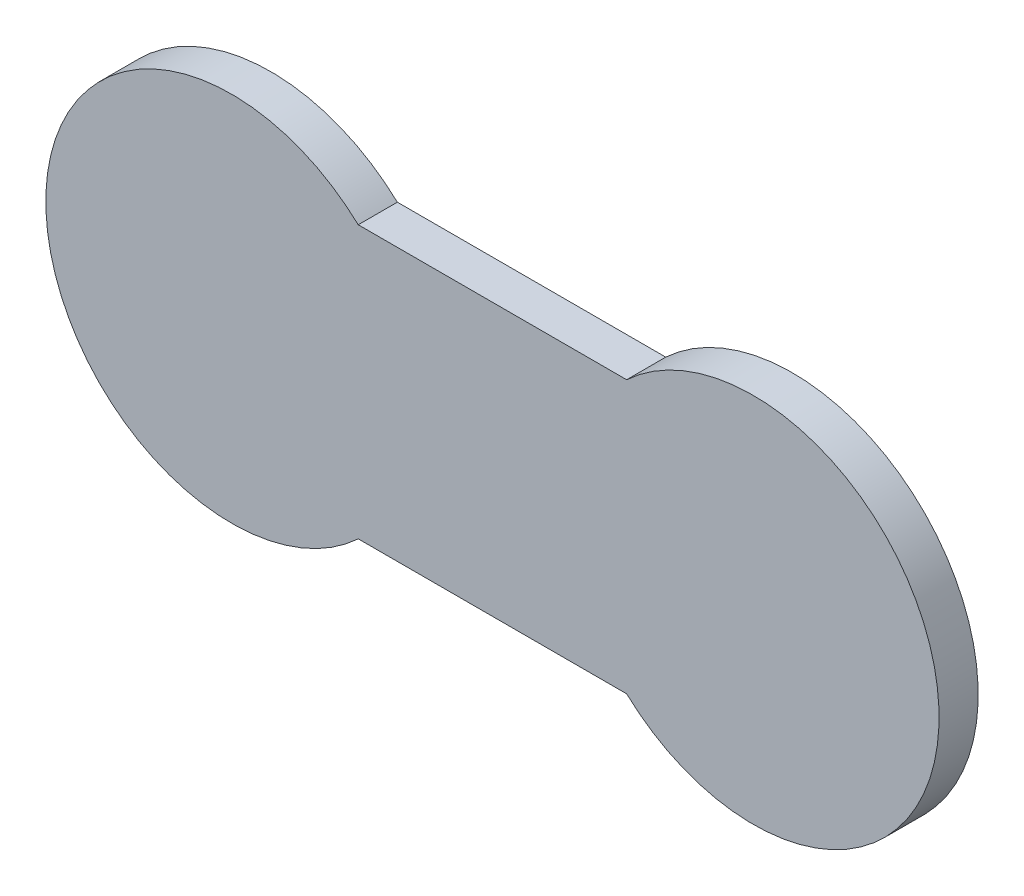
ISO-10303-21;
HEADER;
FILE_DESCRIPTION(('STEP AP214'),'2;1');
FILE_NAME('part.step','',(''),(''),'','','');
FILE_SCHEMA(('AUTOMOTIVE_DESIGN { 1 0 10303 214 1 1 1 1 }'));
ENDSEC;
DATA;
#1=APPLICATION_CONTEXT('core data for automotive mechanical design processes');
#2=APPLICATION_PROTOCOL_DEFINITION('international standard','automotive_design',2000,#1);
#3=PRODUCT_CONTEXT('',#1,'mechanical');
#4=PRODUCT('Part','Part','',(#3));
#5=PRODUCT_RELATED_PRODUCT_CATEGORY('part','',(#4));
#6=PRODUCT_DEFINITION_FORMATION('','',#4);
#7=PRODUCT_DEFINITION_CONTEXT('part definition',#1,'design');
#8=PRODUCT_DEFINITION('design','',#6,#7);
#9=PRODUCT_DEFINITION_SHAPE('','',#8);
#10=(LENGTH_UNIT() NAMED_UNIT(*) SI_UNIT(.MILLI.,.METRE.));
#11=(NAMED_UNIT(*) PLANE_ANGLE_UNIT() SI_UNIT($,.RADIAN.));
#12=(NAMED_UNIT(*) SI_UNIT($,.STERADIAN.) SOLID_ANGLE_UNIT());
#13=UNCERTAINTY_MEASURE_WITH_UNIT(LENGTH_MEASURE(1.E-05),#10,'distance_accuracy_value','');
#14=(GEOMETRIC_REPRESENTATION_CONTEXT(3) GLOBAL_UNCERTAINTY_ASSIGNED_CONTEXT((#13)) GLOBAL_UNIT_ASSIGNED_CONTEXT((#10,
#11,#12)) REPRESENTATION_CONTEXT('',''));
#15=CARTESIAN_POINT('',(0.,0.,0.));
#16=DIRECTION('',(0.,0.,1.));
#17=DIRECTION('',(1.,0.,0.));
#18=AXIS2_PLACEMENT_3D('',#15,#16,#17);
#19=CARTESIAN_POINT('',(30.,29.8606797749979,6.));
#20=DIRECTION('',(0.,0.,-1.));
#21=DIRECTION('',(-1.,0.,0.));
#22=AXIS2_PLACEMENT_3D('',#19,#20,#21);
#23=CYLINDRICAL_SURFACE('',#22,28.5);
#24=CARTESIAN_POINT('',(30.,29.8606797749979,0.));
#25=DIRECTION('',(0.,0.,1.));
#26=DIRECTION('',(1.,0.,0.));
#27=AXIS2_PLACEMENT_3D('',#24,#25,#26);
#28=CIRCLE('',#27,28.5);
#29=CARTESIAN_POINT('',(49.4186003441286,50.7213595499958,0.));
#30=VERTEX_POINT('',#29);
#31=CARTESIAN_POINT('',(49.4186003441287,9.,0.));
#32=VERTEX_POINT('',#31);
#33=EDGE_CURVE('E98',#30,#32,#28,.T.);
#34=ORIENTED_EDGE('',*,*,#33,.T.);
#35=DIRECTION('',(0.,0.,-1.));
#36=VECTOR('',#35,1.);
#37=CARTESIAN_POINT('',(49.4186003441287,9.,6.));
#38=LINE('',#37,#36);
#39=CARTESIAN_POINT('',(49.4186003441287,9.,6.));
#40=VERTEX_POINT('',#39);
#41=EDGE_CURVE('E11',#40,#32,#38,.T.);
#42=ORIENTED_EDGE('',*,*,#41,.F.);
#43=CARTESIAN_POINT('',(30.,29.8606797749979,6.));
#44=DIRECTION('',(0.,0.,1.));
#45=DIRECTION('',(1.,0.,0.));
#46=AXIS2_PLACEMENT_3D('',#43,#44,#45);
#47=CIRCLE('',#46,28.5);
#48=CARTESIAN_POINT('',(49.4186003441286,50.7213595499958,6.));
#49=VERTEX_POINT('',#48);
#50=EDGE_CURVE('E86',#49,#40,#47,.T.);
#51=ORIENTED_EDGE('',*,*,#50,.F.);
#52=DIRECTION('',(0.,0.,-1.));
#53=VECTOR('',#52,1.);
#54=CARTESIAN_POINT('',(49.4186003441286,50.7213595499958,6.));
#55=LINE('',#54,#53);
#56=EDGE_CURVE('E94',#49,#30,#55,.T.);
#57=ORIENTED_EDGE('',*,*,#56,.T.);
#58=EDGE_LOOP('',(#34,#42,#51,#57));
#59=FACE_BOUND('',#58,.T.);
#60=ADVANCED_FACE('F35',(#59),#23,.T.);
#61=CARTESIAN_POINT('',(49.4186003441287,9.,6.));
#62=DIRECTION('',(0.,1.,0.));
#63=DIRECTION('',(0.,0.,1.));
#64=AXIS2_PLACEMENT_3D('',#61,#62,#63);
#65=PLANE('',#64);
#66=DIRECTION('',(1.,0.,0.));
#67=VECTOR('',#66,1.);
#68=CARTESIAN_POINT('',(49.4186003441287,9.,0.));
#69=LINE('',#68,#67);
#70=CARTESIAN_POINT('',(90.5813996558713,9.,0.));
#71=VERTEX_POINT('',#70);
#72=EDGE_CURVE('E90',#32,#71,#69,.T.);
#73=ORIENTED_EDGE('',*,*,#72,.T.);
#74=DIRECTION('',(0.,0.,-1.));
#75=VECTOR('',#74,1.);
#76=CARTESIAN_POINT('',(90.5813996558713,9.,6.));
#77=LINE('',#76,#75);
#78=CARTESIAN_POINT('',(90.5813996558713,9.,6.));
#79=VERTEX_POINT('',#78);
#80=EDGE_CURVE('E43',#79,#71,#77,.T.);
#81=ORIENTED_EDGE('',*,*,#80,.F.);
#82=DIRECTION('',(1.,0.,0.));
#83=VECTOR('',#82,1.);
#84=CARTESIAN_POINT('',(49.4186003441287,9.,6.));
#85=LINE('',#84,#83);
#86=EDGE_CURVE('E81',#40,#79,#85,.T.);
#87=ORIENTED_EDGE('',*,*,#86,.F.);
#88=ORIENTED_EDGE('',*,*,#41,.T.);
#89=EDGE_LOOP('',(#73,#81,#87,#88));
#90=FACE_BOUND('',#89,.T.);
#91=ADVANCED_FACE('F89',(#90),#65,.F.);
#92=CARTESIAN_POINT('',(110.,29.8606797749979,6.));
#93=DIRECTION('',(0.,0.,-1.));
#94=DIRECTION('',(-1.,0.,0.));
#95=AXIS2_PLACEMENT_3D('',#92,#93,#94);
#96=CYLINDRICAL_SURFACE('',#95,28.5);
#97=CARTESIAN_POINT('',(110.,29.8606797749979,0.));
#98=DIRECTION('',(0.,0.,1.));
#99=DIRECTION('',(-1.,0.,0.));
#100=AXIS2_PLACEMENT_3D('',#97,#98,#99);
#101=CIRCLE('',#100,28.5);
#102=CARTESIAN_POINT('',(90.5813996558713,50.7213595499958,0.));
#103=VERTEX_POINT('',#102);
#104=EDGE_CURVE('E68',#71,#103,#101,.T.);
#105=ORIENTED_EDGE('',*,*,#104,.T.);
#106=DIRECTION('',(0.,0.,-1.));
#107=VECTOR('',#106,1.);
#108=CARTESIAN_POINT('',(90.5813996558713,50.7213595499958,6.));
#109=LINE('',#108,#107);
#110=CARTESIAN_POINT('',(90.5813996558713,50.7213595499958,6.));
#111=VERTEX_POINT('',#110);
#112=EDGE_CURVE('E91',#111,#103,#109,.T.);
#113=ORIENTED_EDGE('',*,*,#112,.F.);
#114=CARTESIAN_POINT('',(110.,29.8606797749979,6.));
#115=DIRECTION('',(0.,0.,1.));
#116=DIRECTION('',(-1.,0.,0.));
#117=AXIS2_PLACEMENT_3D('',#114,#115,#116);
#118=CIRCLE('',#117,28.5);
#119=EDGE_CURVE('E84',#79,#111,#118,.T.);
#120=ORIENTED_EDGE('',*,*,#119,.F.);
#121=ORIENTED_EDGE('',*,*,#80,.T.);
#122=EDGE_LOOP('',(#105,#113,#120,#121));
#123=FACE_BOUND('',#122,.T.);
#124=ADVANCED_FACE('F92',(#123),#96,.T.);
#125=CARTESIAN_POINT('',(49.4186003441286,50.7213595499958,6.));
#126=DIRECTION('',(0.,-1.,0.));
#127=DIRECTION('',(0.,0.,-1.));
#128=AXIS2_PLACEMENT_3D('',#125,#126,#127);
#129=PLANE('',#128);
#130=DIRECTION('',(-1.,0.,0.));
#131=VECTOR('',#130,1.);
#132=CARTESIAN_POINT('',(49.4186003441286,50.7213595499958,0.));
#133=LINE('',#132,#131);
#134=EDGE_CURVE('E74',#103,#30,#133,.T.);
#135=ORIENTED_EDGE('',*,*,#134,.T.);
#136=ORIENTED_EDGE('',*,*,#56,.F.);
#137=DIRECTION('',(-1.,0.,0.));
#138=VECTOR('',#137,1.);
#139=CARTESIAN_POINT('',(49.4186003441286,50.7213595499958,6.));
#140=LINE('',#139,#138);
#141=EDGE_CURVE('E51',#111,#49,#140,.T.);
#142=ORIENTED_EDGE('',*,*,#141,.F.);
#143=ORIENTED_EDGE('',*,*,#112,.T.);
#144=EDGE_LOOP('',(#135,#136,#142,#143));
#145=FACE_BOUND('',#144,.T.);
#146=ADVANCED_FACE('F105',(#145),#129,.F.);
#147=CARTESIAN_POINT('',(30.,29.8606797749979,6.));
#148=DIRECTION('',(0.,0.,1.));
#149=DIRECTION('',(1.,0.,0.));
#150=AXIS2_PLACEMENT_3D('',#147,#148,#149);
#151=PLANE('',#150);
#152=ORIENTED_EDGE('',*,*,#50,.T.);
#153=ORIENTED_EDGE('',*,*,#86,.T.);
#154=ORIENTED_EDGE('',*,*,#119,.T.);
#155=ORIENTED_EDGE('',*,*,#141,.T.);
#156=EDGE_LOOP('',(#152,#153,#154,#155));
#157=FACE_BOUND('',#156,.T.);
#158=ADVANCED_FACE('F82',(#157),#151,.T.);
#159=CARTESIAN_POINT('',(30.,29.8606797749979,0.));
#160=DIRECTION('',(0.,0.,1.));
#161=DIRECTION('',(1.,0.,0.));
#162=AXIS2_PLACEMENT_3D('',#159,#160,#161);
#163=PLANE('',#162);
#164=ORIENTED_EDGE('',*,*,#33,.F.);
#165=ORIENTED_EDGE('',*,*,#134,.F.);
#166=ORIENTED_EDGE('',*,*,#104,.F.);
#167=ORIENTED_EDGE('',*,*,#72,.F.);
#168=EDGE_LOOP('',(#164,#165,#166,#167));
#169=FACE_BOUND('',#168,.T.);
#170=ADVANCED_FACE('F108',(#169),#163,.F.);
#171=CLOSED_SHELL('',(#60,#91,#124,#146,#158,#170));
#172=MANIFOLD_SOLID_BREP('B2',#171);
#173=ADVANCED_BREP_SHAPE_REPRESENTATION('',(#18,#172),#14);
#174=SHAPE_DEFINITION_REPRESENTATION(#9,#173);
ENDSEC;
END-ISO-10303-21;
